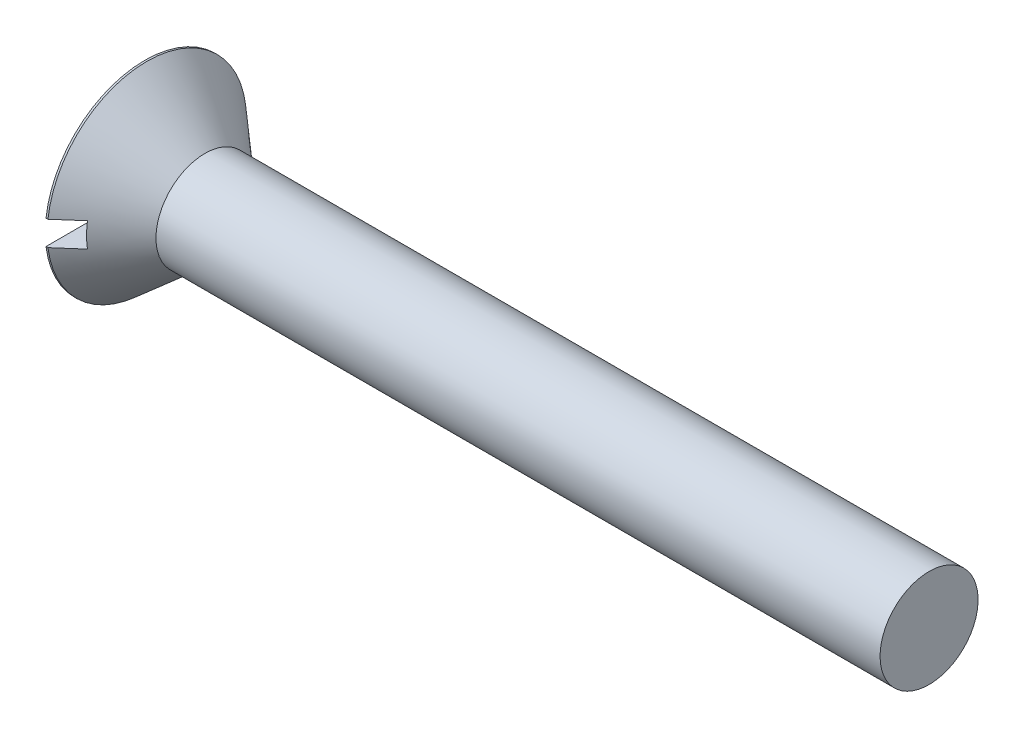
from build123d import *

# Parameters (mm, degrees)
SKETCH6_W  = 19.3548
SKETCH6_H  = 2.3876
SLOT_DEPTH = 2.2352


with BuildPart() as part:
    # BodySke → Base-Revolve (revolve)
    with BuildSketch(Plane.XY, mode=Mode.PRIVATE) as base_revolve_sk:
        Polygon((0, 0), (0, 9.6774), (0.188054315, 9.6774), (5.842, 4.7625), (76.2, 4.7625), (76.2, 0), align=None)
    revolve(base_revolve_sk.sketch.rotate(Axis((-6.35, 0, 0), (1, 0, 0)), 90), axis=Axis((-6.35, 0, 0), (1, 0, 0)))

    # Sketch6 → Slot (cut)
    with BuildSketch(Plane.ZY):
        Rectangle(SKETCH6_W, SKETCH6_H)
    extrude(amount=-SLOT_DEPTH, mode=Mode.SUBTRACT)


solid = part.part
